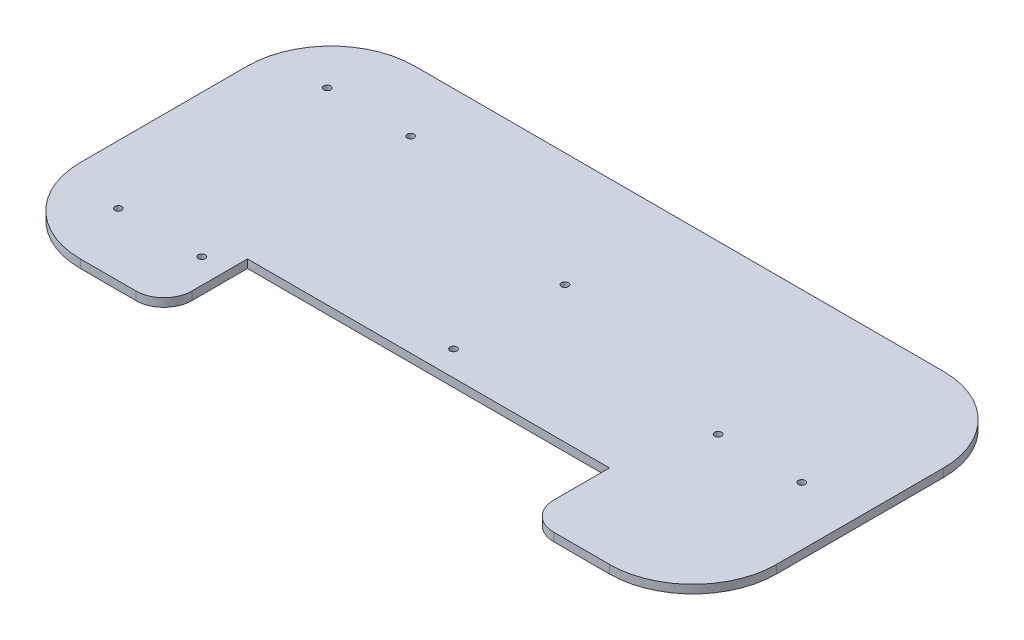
from build123d import *

# Parameters (mm, degrees)
CROQUIS1_W              = 250
CROQUIS1_H              = 120
SALIENTE_EXTRUIR1_DEPTH = 3
REDONDEO1_R             = 30
CROQUIS2_W              = 130
CROQUIS2_H              = 30
CORTAR_EXTRUIR1_DEPTH   = 10
REDONDEO2_R             = 10
CROQUIS3_R              = 1.25
CORTAR_EXTRUIR2_DEPTH   = 139.686697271


with BuildPart() as part:
    # Croquis1 → Saliente-Extruir1 (new body)
    with BuildSketch(Plane(origin=(0, 0, 0), x_dir=(1, 0, 0), z_dir=(0, 1, 0))):
        Rectangle(CROQUIS1_W, CROQUIS1_H)
    extrude(amount=SALIENTE_EXTRUIR1_DEPTH)

    # Redondeo1
    redondeo1_edges = [part.edges().sort_by_distance(p)[0] for p in [
        (125, 1.5, 60),
        (-125, 1.5, 60),
        (-125, 1.5, -60),
        (125, 1.5, -60),
    ]]
    fillet(redondeo1_edges, radius=REDONDEO1_R)

    # Croquis2 → Cortar-Extruir1 (cut)
    with BuildSketch(Plane.XZ):
        with Locations((0, 45)):
            Rectangle(CROQUIS2_W, CROQUIS2_H)
    extrude(amount=-CORTAR_EXTRUIR1_DEPTH, mode=Mode.SUBTRACT)

    # Redondeo2
    redondeo2_edges = [part.edges().sort_by_distance(p)[0] for p in [
        (-65, 1.5, 60),
        (65, 1.5, 60),
    ]]
    fillet(redondeo2_edges, radius=REDONDEO2_R)

    # Croquis3 → Cortar-Extruir2 (cut, through all)
    with BuildSketch(Plane.XZ):
        with Locations(Location((104.028688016, 0, 0), (0, 0, 270))):
            Circle(CROQUIS3_R)
        with Locations(Location((74.028688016, 0, 0), (0, 0, 270))):
            Circle(CROQUIS3_R)
        with Locations(Location((0, 21, 0), (0, 0, 270))):
            Circle(CROQUIS3_R)
        with Locations(Location((0, -19, 0), (0, 0, 270))):
            Circle(CROQUIS3_R)
        with Locations(Location((-73.883549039, 37.5, 0), (0, 0, 270))):
            Circle(CROQUIS3_R)
        with Locations(Location((-103.883549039, 37.5, 0), (0, 0, 270))):
            Circle(CROQUIS3_R)
        with Locations(Location((-103.883549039, -37.5, 0), (0, 0, 270))):
            Circle(CROQUIS3_R)
        with Locations(Location((-73.883549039, -37.5, 0), (0, 0, 270))):
            Circle(CROQUIS3_R)
    extrude(amount=-CORTAR_EXTRUIR2_DEPTH, mode=Mode.SUBTRACT)


solid = part.part
